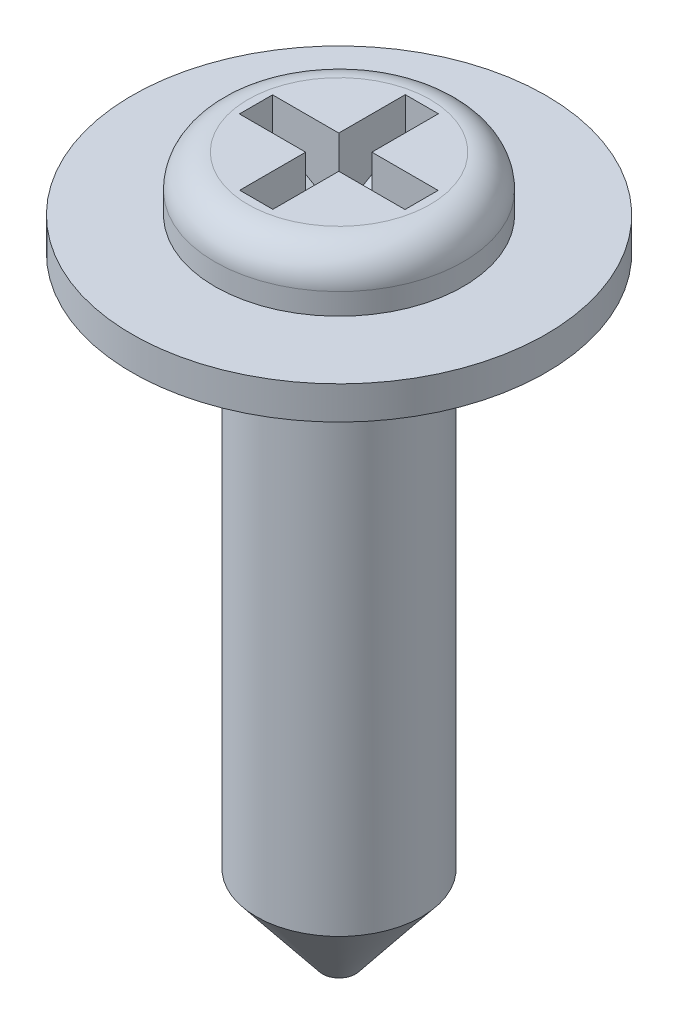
from build123d import *
from OCP.BRepFilletAPI import BRepFilletAPI_MakeChamfer

# Parameters (mm, degrees)
ENL_V_MAT_EXTRU_1_DEPTH = 0.8
CHANFREIN1_SIZE         = 0.4
CHANFREIN1_SIZE2        = 0.692820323


with BuildPart() as part:
    # Esquisse1 → R_volution1 (revolve)
    with BuildSketch(Plane.XY, mode=Mode.PRIVATE) as r_volution1_sk:
        with BuildLine():
            Line((1.5, -0.4), (1.5, -0.658040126))
            Line((1.5, -0.658040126), (2.5, -0.658040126))
            Line((2.5, -0.658040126), (2.5, -1.058040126))
            Line((2.5, -1.058040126), (1, -1.058040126))
            Line((1, -1.058040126), (1, -7.5))
            Line((1, -7.5), (0.2, -8.5))
            Line((0.2, -8.5), (0, -8.5))
            Line((0, -8.5), (0, 0))
            Line((0, 0), (1.1, 0))
            ThreePointArc((1.1, 0), (1.382842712, -0.117157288), (1.5, -0.4))
        make_face()
    revolve(r_volution1_sk.sketch.rotate(Axis((0, -8.5, 0), (0, 1, 0)), 90), axis=Axis((0, -8.5, 0), (0, 1, 0)))

    # Esquisse2 → Enl_v. mat.-Extru.1 (cut)
    with BuildSketch(Plane(origin=(0, 0, 0), x_dir=(1, 0, 0), z_dir=(0, 1, 0))):
        Polygon((-0.2, -0.203580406), (-0.2, -1), (0.2, -1), (0.2, -0.203580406), (1, -0.203580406), (1, 0.196419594), (0.2, 0.196419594), (0.2, 1), (-0.2, 1), (-0.2, 0.196419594), (-1, 0.196419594), (-1, -0.203580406), align=None)
    extrude(amount=-ENL_V_MAT_EXTRU_1_DEPTH, mode=Mode.SUBTRACT)

    # Chanfrein1: one chamfer whose edges measure the first distance from different faces: ONE call of the kernel's chamfer builder (chamfer() names one face for all edges)
    chanfrein1_edges_1 = [part.edges().sort_by_distance(p)[0] for p in [
        (-1, -0.8, 0.003580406),
    ]]
    chanfrein1_side_1 = [part.faces().sort_by_distance(p)[0] for p in [
        (-1, -0.4, 0.003580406),
    ]]
    chanfrein1_edges_2 = [part.edges().sort_by_distance(p)[0] for p in [
        (0, -0.8, -1),
    ]]
    chanfrein1_side_2 = [part.faces().sort_by_distance(p)[0] for p in [
        (0, -0.4, -1),
    ]]
    chanfrein1_edges_3 = [part.edges().sort_by_distance(p)[0] for p in [
        (1, -0.8, 0.003580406),
    ]]
    chanfrein1_side_3 = [part.faces().sort_by_distance(p)[0] for p in [
        (1, -0.4, 0.003580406),
    ]]
    chanfrein1_edges_4 = [part.edges().sort_by_distance(p)[0] for p in [
        (0, -0.8, 1),
    ]]
    chanfrein1_side_4 = [part.faces().sort_by_distance(p)[0] for p in [
        (0, -0.4, 1),
    ]]
    chanfrein1 = BRepFilletAPI_MakeChamfer(part.part.solid().wrapped)
    for e in chanfrein1_edges_1:
        chanfrein1.Add(CHANFREIN1_SIZE, CHANFREIN1_SIZE2, e.wrapped, chanfrein1_side_1[0].wrapped)  # the first distance lies on this face
    for e in chanfrein1_edges_2:
        chanfrein1.Add(CHANFREIN1_SIZE, CHANFREIN1_SIZE2, e.wrapped, chanfrein1_side_2[0].wrapped)  # the first distance lies on this face
    for e in chanfrein1_edges_3:
        chanfrein1.Add(CHANFREIN1_SIZE, CHANFREIN1_SIZE2, e.wrapped, chanfrein1_side_3[0].wrapped)  # the first distance lies on this face
    for e in chanfrein1_edges_4:
        chanfrein1.Add(CHANFREIN1_SIZE, CHANFREIN1_SIZE2, e.wrapped, chanfrein1_side_4[0].wrapped)  # the first distance lies on this face
    add(Compound.cast(chanfrein1.Shape()), mode=Mode.REPLACE)


solid = part.part
